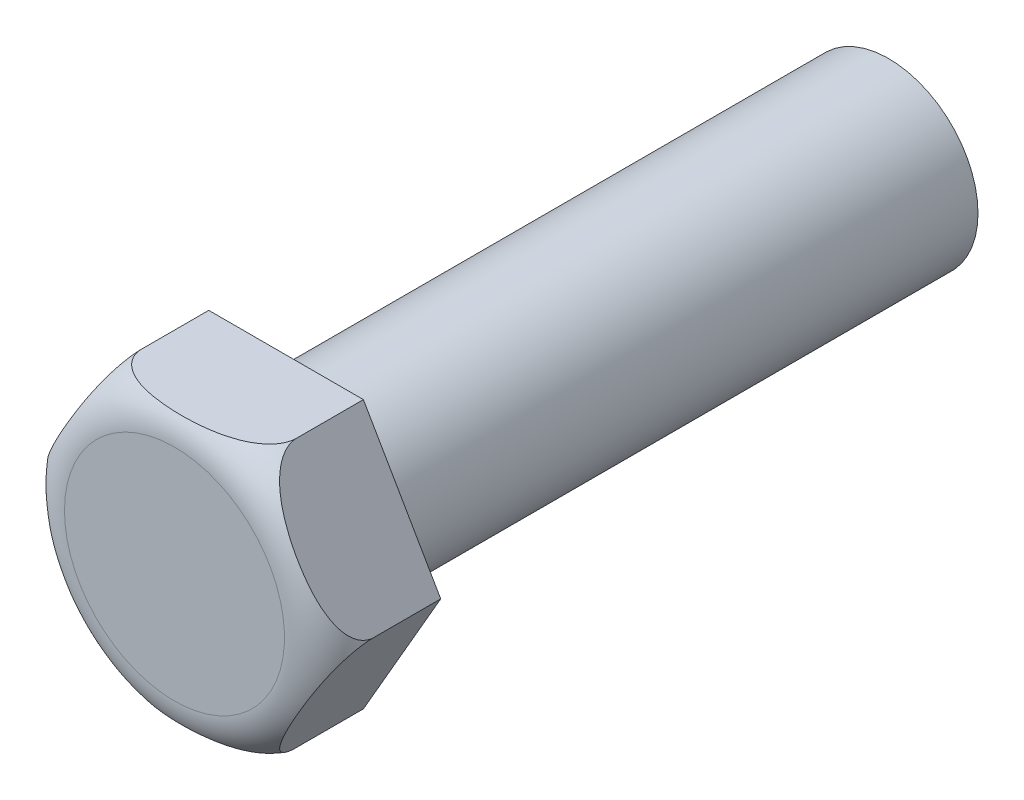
from build123d import *

# Parameters (mm, degrees)
SKETCH1_R      = 4
EXTRUDE1_DEPTH = 27
EXTRUDE2_DEPTH = 5


with BuildPart() as part:
    # Sketch1 → Extrude1 (new body)
    with BuildSketch(Plane.XY):
        with Locations((35, 0)):
            Circle(SKETCH1_R)
    extrude(amount=-EXTRUDE1_DEPTH)

    # Sketch2 → Extrude2 (add)
    with BuildSketch(Plane.XY):
        Polygon((41.92820323, 0), (38.464101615, 6), (31.535898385, 6), (28.07179677, 0), (31.535898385, -6), (38.464101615, -6), align=None)
    extrude(amount=EXTRUDE2_DEPTH)

    # Sketch3 → Cut-Revolve1 (revolve, cut)
    with BuildSketch(Plane.XZ, mode=Mode.PRIVATE) as cut_revolve1_sk:
        with BuildLine():
            Line((39.92820323, 5), (39.92820323, 6.295415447))
            Line((39.92820323, 6.295415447), (43.315388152, 6.295415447))
            Line((43.315388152, 6.295415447), (43.315388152, 3))
            Line((43.315388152, 3), (41.92820323, 3))
            ThreePointArc((41.92820323, 3), (41.342416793, 4.414213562), (39.92820323, 5))
        make_face()
    revolve(cut_revolve1_sk.sketch.rotate(Axis((35, 0, -27), (0, 0, 1)), 180), axis=Axis((35, 0, -27), (0, 0, 1)), mode=Mode.SUBTRACT)


solid = part.part
